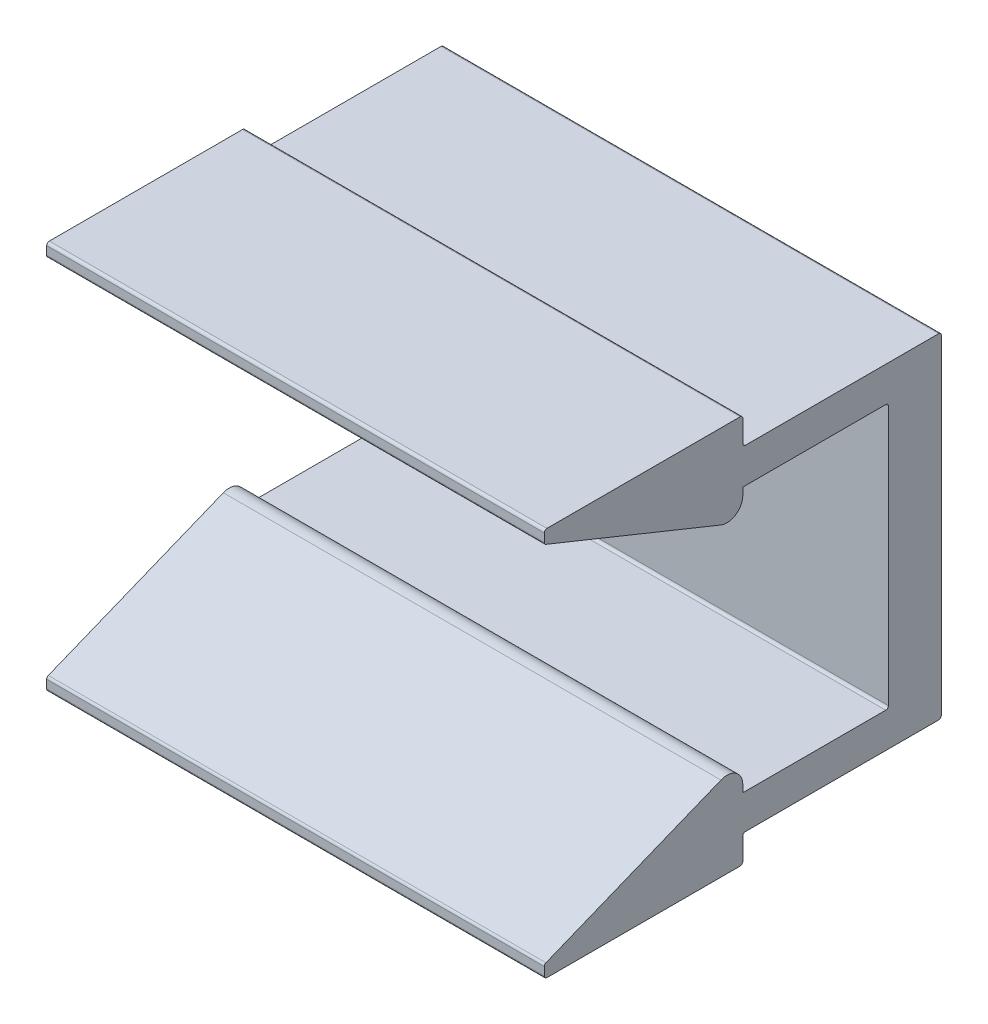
ISO-10303-21;
HEADER;
FILE_DESCRIPTION(('STEP AP214'),'2;1');
FILE_NAME('part.step','',(''),(''),'','','');
FILE_SCHEMA(('AUTOMOTIVE_DESIGN { 1 0 10303 214 1 1 1 1 }'));
ENDSEC;
DATA;
#1=APPLICATION_CONTEXT('core data for automotive mechanical design processes');
#2=APPLICATION_PROTOCOL_DEFINITION('international standard','automotive_design',2000,#1);
#3=PRODUCT_CONTEXT('',#1,'mechanical');
#4=PRODUCT('Part','Part','',(#3));
#5=PRODUCT_RELATED_PRODUCT_CATEGORY('part','',(#4));
#6=PRODUCT_DEFINITION_FORMATION('','',#4);
#7=PRODUCT_DEFINITION_CONTEXT('part definition',#1,'design');
#8=PRODUCT_DEFINITION('design','',#6,#7);
#9=PRODUCT_DEFINITION_SHAPE('','',#8);
#10=(LENGTH_UNIT() NAMED_UNIT(*) SI_UNIT(.MILLI.,.METRE.));
#11=(NAMED_UNIT(*) PLANE_ANGLE_UNIT() SI_UNIT($,.RADIAN.));
#12=(NAMED_UNIT(*) SI_UNIT($,.STERADIAN.) SOLID_ANGLE_UNIT());
#13=UNCERTAINTY_MEASURE_WITH_UNIT(LENGTH_MEASURE(1.E-05),#10,'distance_accuracy_value','');
#14=(GEOMETRIC_REPRESENTATION_CONTEXT(3) GLOBAL_UNCERTAINTY_ASSIGNED_CONTEXT((#13)) GLOBAL_UNIT_ASSIGNED_CONTEXT((#10,
#11,#12)) REPRESENTATION_CONTEXT('',''));
#15=CARTESIAN_POINT('',(0.,0.,0.));
#16=DIRECTION('',(0.,0.,1.));
#17=DIRECTION('',(1.,0.,0.));
#18=AXIS2_PLACEMENT_3D('',#15,#16,#17);
#19=CARTESIAN_POINT('',(11.938,6.223,2.54));
#20=DIRECTION('',(0.,0.,-1.));
#21=DIRECTION('',(0.,1.,0.));
#22=AXIS2_PLACEMENT_3D('',#19,#20,#21);
#23=PLANE('',#22);
#24=DIRECTION('',(0.,-1.,0.));
#25=VECTOR('',#24,1.);
#26=CARTESIAN_POINT('',(-11.938,6.223,2.54));
#27=LINE('',#26,#25);
#28=CARTESIAN_POINT('',(-11.938,6.223,2.54));
#29=VERTEX_POINT('',#28);
#30=CARTESIAN_POINT('',(-11.938,-6.223,2.54));
#31=VERTEX_POINT('',#30);
#32=EDGE_CURVE('E218',#29,#31,#27,.T.);
#33=ORIENTED_EDGE('',*,*,#32,.T.);
#34=DIRECTION('',(-1.,0.,0.));
#35=VECTOR('',#34,1.);
#36=CARTESIAN_POINT('',(11.938,-6.223,2.54));
#37=LINE('',#36,#35);
#38=CARTESIAN_POINT('',(11.938,-6.223,2.54));
#39=VERTEX_POINT('',#38);
#40=EDGE_CURVE('E426',#39,#31,#37,.T.);
#41=ORIENTED_EDGE('',*,*,#40,.F.);
#42=DIRECTION('',(0.,-1.,0.));
#43=VECTOR('',#42,1.);
#44=CARTESIAN_POINT('',(11.938,6.223,2.54));
#45=LINE('',#44,#43);
#46=CARTESIAN_POINT('',(11.938,6.223,2.54));
#47=VERTEX_POINT('',#46);
#48=EDGE_CURVE('E293',#47,#39,#45,.T.);
#49=ORIENTED_EDGE('',*,*,#48,.F.);
#50=DIRECTION('',(-1.,0.,0.));
#51=VECTOR('',#50,1.);
#52=CARTESIAN_POINT('',(11.938,6.223,2.54));
#53=LINE('',#52,#51);
#54=EDGE_CURVE('E23',#47,#29,#53,.T.);
#55=ORIENTED_EDGE('',*,*,#54,.T.);
#56=EDGE_LOOP('',(#33,#41,#49,#55));
#57=FACE_BOUND('',#56,.T.);
#58=CARTESIAN_POINT('',(0.,0.,2.54));
#59=DIRECTION('',(0.,0.,-1.));
#60=DIRECTION('',(0.,1.,0.));
#61=AXIS2_PLACEMENT_3D('',#58,#59,#60);
#62=CIRCLE('',#61,3.3655);
#63=CARTESIAN_POINT('',(0.,3.3655,2.54));
#64=VERTEX_POINT('',#63);
#65=EDGE_CURVE('E230',#64,#64,#62,.F.);
#66=ORIENTED_EDGE('',*,*,#65,.F.);
#67=EDGE_LOOP('',(#66));
#68=FACE_BOUND('',#67,.T.);
#69=ADVANCED_FACE('F14',(#57,#68),#23,.F.);
#70=CARTESIAN_POINT('',(11.938,-7.8994,0.));
#71=DIRECTION('',(0.,0.,1.));
#72=DIRECTION('',(1.,0.,0.));
#73=AXIS2_PLACEMENT_3D('',#70,#71,#72);
#74=PLANE('',#73);
#75=DIRECTION('',(0.,1.,0.));
#76=VECTOR('',#75,1.);
#77=CARTESIAN_POINT('',(-11.938,-7.8994,0.));
#78=LINE('',#77,#76);
#79=CARTESIAN_POINT('',(-11.938,-7.8994,0.));
#80=VERTEX_POINT('',#79);
#81=CARTESIAN_POINT('',(-11.938,7.8994,0.));
#82=VERTEX_POINT('',#81);
#83=EDGE_CURVE('E264',#80,#82,#78,.T.);
#84=ORIENTED_EDGE('',*,*,#83,.T.);
#85=DIRECTION('',(-1.,0.,0.));
#86=VECTOR('',#85,1.);
#87=CARTESIAN_POINT('',(11.938,7.8994,0.));
#88=LINE('',#87,#86);
#89=CARTESIAN_POINT('',(11.938,7.8994,0.));
#90=VERTEX_POINT('',#89);
#91=EDGE_CURVE('E381',#90,#82,#88,.T.);
#92=ORIENTED_EDGE('',*,*,#91,.F.);
#93=DIRECTION('',(0.,1.,0.));
#94=VECTOR('',#93,1.);
#95=CARTESIAN_POINT('',(11.938,-7.8994,0.));
#96=LINE('',#95,#94);
#97=CARTESIAN_POINT('',(11.938,-7.8994,0.));
#98=VERTEX_POINT('',#97);
#99=EDGE_CURVE('E323',#98,#90,#96,.T.);
#100=ORIENTED_EDGE('',*,*,#99,.F.);
#101=DIRECTION('',(-1.,0.,0.));
#102=VECTOR('',#101,1.);
#103=CARTESIAN_POINT('',(11.938,-7.8994,0.));
#104=LINE('',#103,#102);
#105=EDGE_CURVE('E384',#98,#80,#104,.T.);
#106=ORIENTED_EDGE('',*,*,#105,.T.);
#107=EDGE_LOOP('',(#84,#92,#100,#106));
#108=FACE_BOUND('',#107,.T.);
#109=CARTESIAN_POINT('',(0.,0.,0.));
#110=DIRECTION('',(0.,0.,1.));
#111=DIRECTION('',(1.,0.,0.));
#112=AXIS2_PLACEMENT_3D('',#109,#110,#111);
#113=CIRCLE('',#112,3.3655);
#114=CARTESIAN_POINT('',(3.3655,0.,0.));
#115=VERTEX_POINT('',#114);
#116=EDGE_CURVE('E18',#115,#115,#113,.F.);
#117=ORIENTED_EDGE('',*,*,#116,.F.);
#118=EDGE_LOOP('',(#117));
#119=FACE_BOUND('',#118,.T.);
#120=ADVANCED_FACE('F507',(#108,#119),#74,.F.);
#121=CARTESIAN_POINT('',(11.938,6.35,9.525));
#122=DIRECTION('',(0.,1.,0.));
#123=DIRECTION('',(0.,0.,1.));
#124=AXIS2_PLACEMENT_3D('',#121,#122,#123);
#125=PLANE('',#124);
#126=DIRECTION('',(0.,0.,-1.));
#127=VECTOR('',#126,1.);
#128=CARTESIAN_POINT('',(-11.938,6.35,9.525));
#129=LINE('',#128,#127);
#130=CARTESIAN_POINT('',(-11.938,6.35,9.525));
#131=VERTEX_POINT('',#130);
#132=CARTESIAN_POINT('',(-11.938,6.35,2.667));
#133=VERTEX_POINT('',#132);
#134=EDGE_CURVE('E216',#131,#133,#129,.T.);
#135=ORIENTED_EDGE('',*,*,#134,.T.);
#136=DIRECTION('',(-1.,0.,0.));
#137=VECTOR('',#136,1.);
#138=CARTESIAN_POINT('',(11.938,6.35,2.667));
#139=LINE('',#138,#137);
#140=CARTESIAN_POINT('',(11.938,6.35,2.667));
#141=VERTEX_POINT('',#140);
#142=EDGE_CURVE('E9',#141,#133,#139,.T.);
#143=ORIENTED_EDGE('',*,*,#142,.F.);
#144=DIRECTION('',(0.,0.,-1.));
#145=VECTOR('',#144,1.);
#146=CARTESIAN_POINT('',(11.938,6.35,9.525));
#147=LINE('',#146,#145);
#148=CARTESIAN_POINT('',(11.938,6.35,9.525));
#149=VERTEX_POINT('',#148);
#150=EDGE_CURVE('E290',#149,#141,#147,.T.);
#151=ORIENTED_EDGE('',*,*,#150,.F.);
#152=DIRECTION('',(-1.,0.,0.));
#153=VECTOR('',#152,1.);
#154=CARTESIAN_POINT('',(11.938,6.35,9.525));
#155=LINE('',#154,#153);
#156=EDGE_CURVE('E229',#149,#131,#155,.T.);
#157=ORIENTED_EDGE('',*,*,#156,.T.);
#158=EDGE_LOOP('',(#135,#143,#151,#157));
#159=FACE_BOUND('',#158,.T.);
#160=ADVANCED_FACE('F16',(#159),#125,.F.);
#161=CARTESIAN_POINT('',(11.938,6.223,2.667));
#162=DIRECTION('',(-1.,0.,0.));
#163=DIRECTION('',(0.,-1.,0.));
#164=AXIS2_PLACEMENT_3D('',#161,#162,#163);
#165=CYLINDRICAL_SURFACE('',#164,0.127);
#166=CARTESIAN_POINT('',(-11.938,6.223,2.667));
#167=DIRECTION('',(-1.,0.,0.));
#168=DIRECTION('',(0.,-1.,0.));
#169=AXIS2_PLACEMENT_3D('',#166,#167,#168);
#170=CIRCLE('',#169,0.127);
#171=EDGE_CURVE('E212',#133,#29,#170,.T.);
#172=ORIENTED_EDGE('',*,*,#171,.T.);
#173=ORIENTED_EDGE('',*,*,#54,.F.);
#174=CARTESIAN_POINT('',(11.938,6.223,2.667));
#175=DIRECTION('',(-1.,0.,0.));
#176=DIRECTION('',(0.,-1.,0.));
#177=AXIS2_PLACEMENT_3D('',#174,#175,#176);
#178=CIRCLE('',#177,0.127);
#179=EDGE_CURVE('E225',#141,#47,#178,.T.);
#180=ORIENTED_EDGE('',*,*,#179,.F.);
#181=ORIENTED_EDGE('',*,*,#142,.T.);
#182=EDGE_LOOP('',(#172,#173,#180,#181));
#183=FACE_BOUND('',#182,.T.);
#184=ADVANCED_FACE('F224',(#183),#165,.F.);
#185=CARTESIAN_POINT('',(11.938,-6.223,2.667));
#186=DIRECTION('',(-1.,0.,0.));
#187=DIRECTION('',(0.,-1.,0.));
#188=AXIS2_PLACEMENT_3D('',#185,#186,#187);
#189=CYLINDRICAL_SURFACE('',#188,0.127);
#190=CARTESIAN_POINT('',(-11.938,-6.223,2.667));
#191=DIRECTION('',(-1.,0.,0.));
#192=DIRECTION('',(0.,1.,0.));
#193=AXIS2_PLACEMENT_3D('',#190,#191,#192);
#194=CIRCLE('',#193,0.127);
#195=CARTESIAN_POINT('',(-11.938,-6.35,2.667));
#196=VERTEX_POINT('',#195);
#197=EDGE_CURVE('E236',#31,#196,#194,.T.);
#198=ORIENTED_EDGE('',*,*,#197,.T.);
#199=DIRECTION('',(-1.,0.,0.));
#200=VECTOR('',#199,1.);
#201=CARTESIAN_POINT('',(11.938,-6.35,2.667));
#202=LINE('',#201,#200);
#203=CARTESIAN_POINT('',(11.938,-6.35,2.667));
#204=VERTEX_POINT('',#203);
#205=EDGE_CURVE('E423',#204,#196,#202,.T.);
#206=ORIENTED_EDGE('',*,*,#205,.F.);
#207=CARTESIAN_POINT('',(11.938,-6.223,2.667));
#208=DIRECTION('',(-1.,0.,0.));
#209=DIRECTION('',(0.,1.,0.));
#210=AXIS2_PLACEMENT_3D('',#207,#208,#209);
#211=CIRCLE('',#210,0.127);
#212=EDGE_CURVE('E295',#39,#204,#211,.T.);
#213=ORIENTED_EDGE('',*,*,#212,.F.);
#214=ORIENTED_EDGE('',*,*,#40,.T.);
#215=EDGE_LOOP('',(#198,#206,#213,#214));
#216=FACE_BOUND('',#215,.T.);
#217=ADVANCED_FACE('F439',(#216),#189,.F.);
#218=CARTESIAN_POINT('',(11.938,-6.35,9.525));
#219=DIRECTION('',(0.,-1.,0.));
#220=DIRECTION('',(0.,0.,-1.));
#221=AXIS2_PLACEMENT_3D('',#218,#219,#220);
#222=PLANE('',#221);
#223=DIRECTION('',(0.,0.,1.));
#224=VECTOR('',#223,1.);
#225=CARTESIAN_POINT('',(-11.938,-6.35,9.525));
#226=LINE('',#225,#224);
#227=CARTESIAN_POINT('',(-11.938,-6.35,9.525));
#228=VERTEX_POINT('',#227);
#229=EDGE_CURVE('E238',#196,#228,#226,.T.);
#230=ORIENTED_EDGE('',*,*,#229,.T.);
#231=DIRECTION('',(-1.,0.,0.));
#232=VECTOR('',#231,1.);
#233=CARTESIAN_POINT('',(11.938,-6.35,9.525));
#234=LINE('',#233,#232);
#235=CARTESIAN_POINT('',(11.938,-6.35,9.525));
#236=VERTEX_POINT('',#235);
#237=EDGE_CURVE('E420',#236,#228,#234,.T.);
#238=ORIENTED_EDGE('',*,*,#237,.F.);
#239=DIRECTION('',(0.,0.,1.));
#240=VECTOR('',#239,1.);
#241=CARTESIAN_POINT('',(11.938,-6.35,9.525));
#242=LINE('',#241,#240);
#243=EDGE_CURVE('E297',#204,#236,#242,.T.);
#244=ORIENTED_EDGE('',*,*,#243,.F.);
#245=ORIENTED_EDGE('',*,*,#205,.T.);
#246=EDGE_LOOP('',(#230,#238,#244,#245));
#247=FACE_BOUND('',#246,.T.);
#248=ADVANCED_FACE('F442',(#247),#222,.F.);
#249=CARTESIAN_POINT('',(11.938,-6.00626165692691,9.525));
#250=DIRECTION('',(0.,0.,1.));
#251=DIRECTION('',(1.,0.,0.));
#252=AXIS2_PLACEMENT_3D('',#249,#250,#251);
#253=PLANE('',#252);
#254=DIRECTION('',(0.,1.,0.));
#255=VECTOR('',#254,1.);
#256=CARTESIAN_POINT('',(-11.938,-6.00626165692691,9.525));
#257=LINE('',#256,#255);
#258=CARTESIAN_POINT('',(-11.938,-6.00626165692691,9.525));
#259=VERTEX_POINT('',#258);
#260=EDGE_CURVE('E240',#228,#259,#257,.T.);
#261=ORIENTED_EDGE('',*,*,#260,.T.);
#262=DIRECTION('',(-1.,0.,0.));
#263=VECTOR('',#262,1.);
#264=CARTESIAN_POINT('',(11.938,-6.00626165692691,9.525));
#265=LINE('',#264,#263);
#266=CARTESIAN_POINT('',(11.938,-6.00626165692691,9.525));
#267=VERTEX_POINT('',#266);
#268=EDGE_CURVE('E417',#267,#259,#265,.T.);
#269=ORIENTED_EDGE('',*,*,#268,.F.);
#270=DIRECTION('',(0.,1.,0.));
#271=VECTOR('',#270,1.);
#272=CARTESIAN_POINT('',(11.938,-6.00626165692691,9.525));
#273=LINE('',#272,#271);
#274=EDGE_CURVE('E299',#236,#267,#273,.T.);
#275=ORIENTED_EDGE('',*,*,#274,.F.);
#276=ORIENTED_EDGE('',*,*,#237,.T.);
#277=EDGE_LOOP('',(#261,#269,#275,#276));
#278=FACE_BOUND('',#277,.T.);
#279=ADVANCED_FACE('F447',(#278),#253,.F.);
#280=CARTESIAN_POINT('',(11.938,-6.00626165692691,10.287));
#281=DIRECTION('',(-1.,0.,0.));
#282=DIRECTION('',(0.,-1.,0.));
#283=AXIS2_PLACEMENT_3D('',#280,#281,#282);
#284=CYLINDRICAL_SURFACE('',#283,0.762);
#285=CARTESIAN_POINT('',(-11.938,-6.00626165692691,10.287));
#286=DIRECTION('',(1.,0.,0.));
#287=DIRECTION('',(0.,-1.,0.));
#288=AXIS2_PLACEMENT_3D('',#285,#286,#287);
#289=CIRCLE('',#288,0.762);
#290=CARTESIAN_POINT('',(-11.938,-5.29974755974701,10.5724502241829));
#291=VERTEX_POINT('',#290);
#292=EDGE_CURVE('E242',#259,#291,#289,.T.);
#293=ORIENTED_EDGE('',*,*,#292,.T.);
#294=DIRECTION('',(-1.,0.,0.));
#295=VECTOR('',#294,1.);
#296=CARTESIAN_POINT('',(11.938,-5.29974755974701,10.5724502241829));
#297=LINE('',#296,#295);
#298=CARTESIAN_POINT('',(11.938,-5.29974755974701,10.5724502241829));
#299=VERTEX_POINT('',#298);
#300=EDGE_CURVE('E414',#299,#291,#297,.T.);
#301=ORIENTED_EDGE('',*,*,#300,.F.);
#302=CARTESIAN_POINT('',(11.938,-6.00626165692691,10.287));
#303=DIRECTION('',(1.,0.,0.));
#304=DIRECTION('',(0.,-1.,0.));
#305=AXIS2_PLACEMENT_3D('',#302,#303,#304);
#306=CIRCLE('',#305,0.762);
#307=EDGE_CURVE('E301',#267,#299,#306,.T.);
#308=ORIENTED_EDGE('',*,*,#307,.F.);
#309=ORIENTED_EDGE('',*,*,#268,.T.);
#310=EDGE_LOOP('',(#293,#301,#308,#309));
#311=FACE_BOUND('',#310,.T.);
#312=ADVANCED_FACE('F453',(#311),#284,.T.);
#313=CARTESIAN_POINT('',(11.938,-8.69281023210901,18.9705750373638));
#314=DIRECTION('',(0.,-0.92718385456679,-0.374606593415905));
#315=DIRECTION('',(0.,0.374606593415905,-0.92718385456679));
#316=AXIS2_PLACEMENT_3D('',#313,#314,#315);
#317=PLANE('',#316);
#318=DIRECTION('',(0.,-0.374606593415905,0.92718385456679));
#319=VECTOR('',#318,1.);
#320=CARTESIAN_POINT('',(-11.938,-8.69281023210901,18.9705750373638));
#321=LINE('',#320,#319);
#322=CARTESIAN_POINT('',(-11.938,-8.69281023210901,18.9705750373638));
#323=VERTEX_POINT('',#322);
#324=EDGE_CURVE('E244',#291,#323,#321,.T.);
#325=ORIENTED_EDGE('',*,*,#324,.T.);
#326=DIRECTION('',(-1.,0.,0.));
#327=VECTOR('',#326,1.);
#328=CARTESIAN_POINT('',(11.938,-8.69281023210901,18.9705750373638));
#329=LINE('',#328,#327);
#330=CARTESIAN_POINT('',(11.938,-8.69281023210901,18.9705750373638));
#331=VERTEX_POINT('',#330);
#332=EDGE_CURVE('E411',#331,#323,#329,.T.);
#333=ORIENTED_EDGE('',*,*,#332,.F.);
#334=DIRECTION('',(0.,-0.374606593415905,0.92718385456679));
#335=VECTOR('',#334,1.);
#336=CARTESIAN_POINT('',(11.938,-8.69281023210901,18.9705750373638));
#337=LINE('',#336,#335);
#338=EDGE_CURVE('E303',#299,#331,#337,.T.);
#339=ORIENTED_EDGE('',*,*,#338,.F.);
#340=ORIENTED_EDGE('',*,*,#300,.T.);
#341=EDGE_LOOP('',(#325,#333,#339,#340));
#342=FACE_BOUND('',#341,.T.);
#343=ADVANCED_FACE('F457',(#342),#317,.F.);
#344=CARTESIAN_POINT('',(11.938,-8.81056258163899,18.923));
#345=DIRECTION('',(-1.,0.,0.));
#346=DIRECTION('',(0.,-1.,0.));
#347=AXIS2_PLACEMENT_3D('',#344,#345,#346);
#348=CYLINDRICAL_SURFACE('',#347,0.126999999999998);
#349=CARTESIAN_POINT('',(-11.938,-8.81056258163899,18.923));
#350=DIRECTION('',(1.,0.,0.));
#351=DIRECTION('',(0.,-1.,0.));
#352=AXIS2_PLACEMENT_3D('',#349,#350,#351);
#353=CIRCLE('',#352,0.126999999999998);
#354=CARTESIAN_POINT('',(-11.938,-8.81056258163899,19.05));
#355=VERTEX_POINT('',#354);
#356=EDGE_CURVE('E246',#323,#355,#353,.T.);
#357=ORIENTED_EDGE('',*,*,#356,.T.);
#358=DIRECTION('',(-1.,0.,0.));
#359=VECTOR('',#358,1.);
#360=CARTESIAN_POINT('',(11.938,-8.81056258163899,19.05));
#361=LINE('',#360,#359);
#362=CARTESIAN_POINT('',(11.938,-8.81056258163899,19.05));
#363=VERTEX_POINT('',#362);
#364=EDGE_CURVE('E408',#363,#355,#361,.T.);
#365=ORIENTED_EDGE('',*,*,#364,.F.);
#366=CARTESIAN_POINT('',(11.938,-8.81056258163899,18.923));
#367=DIRECTION('',(1.,0.,0.));
#368=DIRECTION('',(0.,-1.,0.));
#369=AXIS2_PLACEMENT_3D('',#366,#367,#368);
#370=CIRCLE('',#369,0.126999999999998);
#371=EDGE_CURVE('E305',#331,#363,#370,.T.);
#372=ORIENTED_EDGE('',*,*,#371,.F.);
#373=ORIENTED_EDGE('',*,*,#332,.T.);
#374=EDGE_LOOP('',(#357,#365,#372,#373));
#375=FACE_BOUND('',#374,.T.);
#376=ADVANCED_FACE('F462',(#375),#348,.T.);
#377=CARTESIAN_POINT('',(11.938,-9.2075,19.05));
#378=DIRECTION('',(0.,0.,-1.));
#379=DIRECTION('',(-1.,0.,0.));
#380=AXIS2_PLACEMENT_3D('',#377,#378,#379);
#381=PLANE('',#380);
#382=DIRECTION('',(0.,-1.,0.));
#383=VECTOR('',#382,1.);
#384=CARTESIAN_POINT('',(-11.938,-9.2075,19.05));
#385=LINE('',#384,#383);
#386=CARTESIAN_POINT('',(-11.938,-9.2075,19.05));
#387=VERTEX_POINT('',#386);
#388=EDGE_CURVE('E248',#355,#387,#385,.T.);
#389=ORIENTED_EDGE('',*,*,#388,.T.);
#390=DIRECTION('',(-1.,0.,0.));
#391=VECTOR('',#390,1.);
#392=CARTESIAN_POINT('',(11.938,-9.2075,19.05));
#393=LINE('',#392,#391);
#394=CARTESIAN_POINT('',(11.938,-9.2075,19.05));
#395=VERTEX_POINT('',#394);
#396=EDGE_CURVE('E405',#395,#387,#393,.T.);
#397=ORIENTED_EDGE('',*,*,#396,.F.);
#398=DIRECTION('',(0.,-1.,0.));
#399=VECTOR('',#398,1.);
#400=CARTESIAN_POINT('',(11.938,-9.2075,19.05));
#401=LINE('',#400,#399);
#402=EDGE_CURVE('E307',#363,#395,#401,.T.);
#403=ORIENTED_EDGE('',*,*,#402,.F.);
#404=ORIENTED_EDGE('',*,*,#364,.T.);
#405=EDGE_LOOP('',(#389,#397,#403,#404));
#406=FACE_BOUND('',#405,.T.);
#407=ADVANCED_FACE('F468',(#406),#381,.F.);
#408=CARTESIAN_POINT('',(11.938,-9.2075,18.923));
#409=DIRECTION('',(-1.,0.,0.));
#410=DIRECTION('',(0.,-1.,0.));
#411=AXIS2_PLACEMENT_3D('',#408,#409,#410);
#412=CYLINDRICAL_SURFACE('',#411,0.126999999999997);
#413=CARTESIAN_POINT('',(-11.938,-9.2075,18.923));
#414=DIRECTION('',(1.,0.,0.));
#415=DIRECTION('',(0.,-1.,0.));
#416=AXIS2_PLACEMENT_3D('',#413,#414,#415);
#417=CIRCLE('',#416,0.126999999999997);
#418=CARTESIAN_POINT('',(-11.938,-9.3345,18.923));
#419=VERTEX_POINT('',#418);
#420=EDGE_CURVE('E250',#387,#419,#417,.T.);
#421=ORIENTED_EDGE('',*,*,#420,.T.);
#422=DIRECTION('',(-1.,0.,0.));
#423=VECTOR('',#422,1.);
#424=CARTESIAN_POINT('',(11.938,-9.3345,18.923));
#425=LINE('',#424,#423);
#426=CARTESIAN_POINT('',(11.938,-9.3345,18.923));
#427=VERTEX_POINT('',#426);
#428=EDGE_CURVE('E402',#427,#419,#425,.T.);
#429=ORIENTED_EDGE('',*,*,#428,.F.);
#430=CARTESIAN_POINT('',(11.938,-9.2075,18.923));
#431=DIRECTION('',(1.,0.,0.));
#432=DIRECTION('',(0.,-1.,0.));
#433=AXIS2_PLACEMENT_3D('',#430,#431,#432);
#434=CIRCLE('',#433,0.126999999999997);
#435=EDGE_CURVE('E309',#395,#427,#434,.T.);
#436=ORIENTED_EDGE('',*,*,#435,.F.);
#437=ORIENTED_EDGE('',*,*,#396,.T.);
#438=EDGE_LOOP('',(#421,#429,#436,#437));
#439=FACE_BOUND('',#438,.T.);
#440=ADVANCED_FACE('F472',(#439),#412,.T.);
#441=CARTESIAN_POINT('',(11.938,-9.3345,9.652));
#442=DIRECTION('',(0.,1.,0.));
#443=DIRECTION('',(0.,0.,1.));
#444=AXIS2_PLACEMENT_3D('',#441,#442,#443);
#445=PLANE('',#444);
#446=DIRECTION('',(0.,0.,-1.));
#447=VECTOR('',#446,1.);
#448=CARTESIAN_POINT('',(-11.938,-9.3345,9.652));
#449=LINE('',#448,#447);
#450=CARTESIAN_POINT('',(-11.938,-9.3345,9.652));
#451=VERTEX_POINT('',#450);
#452=EDGE_CURVE('E252',#419,#451,#449,.T.);
#453=ORIENTED_EDGE('',*,*,#452,.T.);
#454=DIRECTION('',(-1.,0.,0.));
#455=VECTOR('',#454,1.);
#456=CARTESIAN_POINT('',(11.938,-9.3345,9.652));
#457=LINE('',#456,#455);
#458=CARTESIAN_POINT('',(11.938,-9.3345,9.652));
#459=VERTEX_POINT('',#458);
#460=EDGE_CURVE('E399',#459,#451,#457,.T.);
#461=ORIENTED_EDGE('',*,*,#460,.F.);
#462=DIRECTION('',(0.,0.,-1.));
#463=VECTOR('',#462,1.);
#464=CARTESIAN_POINT('',(11.938,-9.3345,9.652));
#465=LINE('',#464,#463);
#466=EDGE_CURVE('E311',#427,#459,#465,.T.);
#467=ORIENTED_EDGE('',*,*,#466,.F.);
#468=ORIENTED_EDGE('',*,*,#428,.T.);
#469=EDGE_LOOP('',(#453,#461,#467,#468));
#470=FACE_BOUND('',#469,.T.);
#471=ADVANCED_FACE('F477',(#470),#445,.F.);
#472=CARTESIAN_POINT('',(11.938,-9.2075,9.652));
#473=DIRECTION('',(-1.,0.,0.));
#474=DIRECTION('',(0.,-1.,0.));
#475=AXIS2_PLACEMENT_3D('',#472,#473,#474);
#476=CYLINDRICAL_SURFACE('',#475,0.127);
#477=CARTESIAN_POINT('',(-11.938,-9.2075,9.652));
#478=DIRECTION('',(1.,0.,0.));
#479=DIRECTION('',(0.,-1.,0.));
#480=AXIS2_PLACEMENT_3D('',#477,#478,#479);
#481=CIRCLE('',#480,0.127);
#482=CARTESIAN_POINT('',(-11.938,-9.2075,9.525));
#483=VERTEX_POINT('',#482);
#484=EDGE_CURVE('E254',#451,#483,#481,.T.);
#485=ORIENTED_EDGE('',*,*,#484,.T.);
#486=DIRECTION('',(-1.,0.,0.));
#487=VECTOR('',#486,1.);
#488=CARTESIAN_POINT('',(11.938,-9.2075,9.525));
#489=LINE('',#488,#487);
#490=CARTESIAN_POINT('',(11.938,-9.2075,9.525));
#491=VERTEX_POINT('',#490);
#492=EDGE_CURVE('E396',#491,#483,#489,.T.);
#493=ORIENTED_EDGE('',*,*,#492,.F.);
#494=CARTESIAN_POINT('',(11.938,-9.2075,9.652));
#495=DIRECTION('',(1.,0.,0.));
#496=DIRECTION('',(0.,-1.,0.));
#497=AXIS2_PLACEMENT_3D('',#494,#495,#496);
#498=CIRCLE('',#497,0.127);
#499=EDGE_CURVE('E313',#459,#491,#498,.T.);
#500=ORIENTED_EDGE('',*,*,#499,.F.);
#501=ORIENTED_EDGE('',*,*,#460,.T.);
#502=EDGE_LOOP('',(#485,#493,#500,#501));
#503=FACE_BOUND('',#502,.T.);
#504=ADVANCED_FACE('F483',(#503),#476,.T.);
#505=CARTESIAN_POINT('',(11.938,-8.1534,9.525));
#506=DIRECTION('',(0.,0.,1.));
#507=DIRECTION('',(1.,0.,0.));
#508=AXIS2_PLACEMENT_3D('',#505,#506,#507);
#509=PLANE('',#508);
#510=DIRECTION('',(0.,1.,0.));
#511=VECTOR('',#510,1.);
#512=CARTESIAN_POINT('',(-11.938,-8.1534,9.525));
#513=LINE('',#512,#511);
#514=CARTESIAN_POINT('',(-11.938,-8.1534,9.525));
#515=VERTEX_POINT('',#514);
#516=EDGE_CURVE('E256',#483,#515,#513,.T.);
#517=ORIENTED_EDGE('',*,*,#516,.T.);
#518=DIRECTION('',(-1.,0.,0.));
#519=VECTOR('',#518,1.);
#520=CARTESIAN_POINT('',(11.938,-8.1534,9.525));
#521=LINE('',#520,#519);
#522=CARTESIAN_POINT('',(11.938,-8.1534,9.525));
#523=VERTEX_POINT('',#522);
#524=EDGE_CURVE('E393',#523,#515,#521,.T.);
#525=ORIENTED_EDGE('',*,*,#524,.F.);
#526=DIRECTION('',(0.,1.,0.));
#527=VECTOR('',#526,1.);
#528=CARTESIAN_POINT('',(11.938,-8.1534,9.525));
#529=LINE('',#528,#527);
#530=EDGE_CURVE('E315',#491,#523,#529,.T.);
#531=ORIENTED_EDGE('',*,*,#530,.F.);
#532=ORIENTED_EDGE('',*,*,#492,.T.);
#533=EDGE_LOOP('',(#517,#525,#531,#532));
#534=FACE_BOUND('',#533,.T.);
#535=ADVANCED_FACE('F487',(#534),#509,.F.);
#536=CARTESIAN_POINT('',(11.938,-8.1534,9.398));
#537=DIRECTION('',(-1.,0.,0.));
#538=DIRECTION('',(0.,-1.,0.));
#539=AXIS2_PLACEMENT_3D('',#536,#537,#538);
#540=CYLINDRICAL_SURFACE('',#539,0.127);
#541=CARTESIAN_POINT('',(-11.938,-8.1534,9.398));
#542=DIRECTION('',(-1.,0.,0.));
#543=DIRECTION('',(0.,1.,0.));
#544=AXIS2_PLACEMENT_3D('',#541,#542,#543);
#545=CIRCLE('',#544,0.127);
#546=CARTESIAN_POINT('',(-11.938,-8.0264,9.398));
#547=VERTEX_POINT('',#546);
#548=EDGE_CURVE('E258',#515,#547,#545,.T.);
#549=ORIENTED_EDGE('',*,*,#548,.T.);
#550=DIRECTION('',(-1.,0.,0.));
#551=VECTOR('',#550,1.);
#552=CARTESIAN_POINT('',(11.938,-8.0264,9.398));
#553=LINE('',#552,#551);
#554=CARTESIAN_POINT('',(11.938,-8.0264,9.398));
#555=VERTEX_POINT('',#554);
#556=EDGE_CURVE('E390',#555,#547,#553,.T.);
#557=ORIENTED_EDGE('',*,*,#556,.F.);
#558=CARTESIAN_POINT('',(11.938,-8.1534,9.398));
#559=DIRECTION('',(-1.,0.,0.));
#560=DIRECTION('',(0.,1.,0.));
#561=AXIS2_PLACEMENT_3D('',#558,#559,#560);
#562=CIRCLE('',#561,0.127);
#563=EDGE_CURVE('E317',#523,#555,#562,.T.);
#564=ORIENTED_EDGE('',*,*,#563,.F.);
#565=ORIENTED_EDGE('',*,*,#524,.T.);
#566=EDGE_LOOP('',(#549,#557,#564,#565));
#567=FACE_BOUND('',#566,.T.);
#568=ADVANCED_FACE('F492',(#567),#540,.F.);
#569=CARTESIAN_POINT('',(11.938,-8.0264,0.127));
#570=DIRECTION('',(0.,1.,0.));
#571=DIRECTION('',(-1.,0.,0.));
#572=AXIS2_PLACEMENT_3D('',#569,#570,#571);
#573=PLANE('',#572);
#574=DIRECTION('',(0.,0.,-1.));
#575=VECTOR('',#574,1.);
#576=CARTESIAN_POINT('',(-11.938,-8.0264,0.127));
#577=LINE('',#576,#575);
#578=CARTESIAN_POINT('',(-11.938,-8.0264,0.127));
#579=VERTEX_POINT('',#578);
#580=EDGE_CURVE('E260',#547,#579,#577,.T.);
#581=ORIENTED_EDGE('',*,*,#580,.T.);
#582=DIRECTION('',(-1.,0.,0.));
#583=VECTOR('',#582,1.);
#584=CARTESIAN_POINT('',(11.938,-8.0264,0.127));
#585=LINE('',#584,#583);
#586=CARTESIAN_POINT('',(11.938,-8.0264,0.127));
#587=VERTEX_POINT('',#586);
#588=EDGE_CURVE('E387',#587,#579,#585,.T.);
#589=ORIENTED_EDGE('',*,*,#588,.F.);
#590=DIRECTION('',(0.,0.,-1.));
#591=VECTOR('',#590,1.);
#592=CARTESIAN_POINT('',(11.938,-8.0264,0.127));
#593=LINE('',#592,#591);
#594=EDGE_CURVE('E319',#555,#587,#593,.T.);
#595=ORIENTED_EDGE('',*,*,#594,.F.);
#596=ORIENTED_EDGE('',*,*,#556,.T.);
#597=EDGE_LOOP('',(#581,#589,#595,#596));
#598=FACE_BOUND('',#597,.T.);
#599=ADVANCED_FACE('F498',(#598),#573,.F.);
#600=CARTESIAN_POINT('',(11.938,-7.8994,0.127));
#601=DIRECTION('',(-1.,0.,0.));
#602=DIRECTION('',(0.,-1.,0.));
#603=AXIS2_PLACEMENT_3D('',#600,#601,#602);
#604=CYLINDRICAL_SURFACE('',#603,0.127);
#605=CARTESIAN_POINT('',(-11.938,-7.8994,0.127));
#606=DIRECTION('',(1.,0.,0.));
#607=DIRECTION('',(0.,-1.,0.));
#608=AXIS2_PLACEMENT_3D('',#605,#606,#607);
#609=CIRCLE('',#608,0.127);
#610=EDGE_CURVE('E262',#579,#80,#609,.T.);
#611=ORIENTED_EDGE('',*,*,#610,.T.);
#612=ORIENTED_EDGE('',*,*,#105,.F.);
#613=CARTESIAN_POINT('',(11.938,-7.8994,0.127));
#614=DIRECTION('',(1.,0.,0.));
#615=DIRECTION('',(0.,-1.,0.));
#616=AXIS2_PLACEMENT_3D('',#613,#614,#615);
#617=CIRCLE('',#616,0.127);
#618=EDGE_CURVE('E321',#587,#98,#617,.T.);
#619=ORIENTED_EDGE('',*,*,#618,.F.);
#620=ORIENTED_EDGE('',*,*,#588,.T.);
#621=EDGE_LOOP('',(#611,#612,#619,#620));
#622=FACE_BOUND('',#621,.T.);
#623=ADVANCED_FACE('F502',(#622),#604,.T.);
#624=CARTESIAN_POINT('',(11.938,7.8994,0.127));
#625=DIRECTION('',(-1.,0.,0.));
#626=DIRECTION('',(0.,-1.,0.));
#627=AXIS2_PLACEMENT_3D('',#624,#625,#626);
#628=CYLINDRICAL_SURFACE('',#627,0.127);
#629=CARTESIAN_POINT('',(-11.938,7.8994,0.127));
#630=DIRECTION('',(1.,0.,0.));
#631=DIRECTION('',(0.,1.,0.));
#632=AXIS2_PLACEMENT_3D('',#629,#630,#631);
#633=CIRCLE('',#632,0.127);
#634=CARTESIAN_POINT('',(-11.938,8.0264,0.127));
#635=VERTEX_POINT('',#634);
#636=EDGE_CURVE('E266',#82,#635,#633,.T.);
#637=ORIENTED_EDGE('',*,*,#636,.T.);
#638=DIRECTION('',(-1.,0.,0.));
#639=VECTOR('',#638,1.);
#640=CARTESIAN_POINT('',(11.938,8.0264,0.127));
#641=LINE('',#640,#639);
#642=CARTESIAN_POINT('',(11.938,8.0264,0.127));
#643=VERTEX_POINT('',#642);
#644=EDGE_CURVE('E378',#643,#635,#641,.T.);
#645=ORIENTED_EDGE('',*,*,#644,.F.);
#646=CARTESIAN_POINT('',(11.938,7.8994,0.127));
#647=DIRECTION('',(1.,0.,0.));
#648=DIRECTION('',(0.,1.,0.));
#649=AXIS2_PLACEMENT_3D('',#646,#647,#648);
#650=CIRCLE('',#649,0.127);
#651=EDGE_CURVE('E325',#90,#643,#650,.T.);
#652=ORIENTED_EDGE('',*,*,#651,.F.);
#653=ORIENTED_EDGE('',*,*,#91,.T.);
#654=EDGE_LOOP('',(#637,#645,#652,#653));
#655=FACE_BOUND('',#654,.T.);
#656=ADVANCED_FACE('F514',(#655),#628,.T.);
#657=CARTESIAN_POINT('',(11.938,8.0264,0.127));
#658=DIRECTION('',(0.,-1.,0.));
#659=DIRECTION('',(1.,0.,0.));
#660=AXIS2_PLACEMENT_3D('',#657,#658,#659);
#661=PLANE('',#660);
#662=DIRECTION('',(0.,0.,1.));
#663=VECTOR('',#662,1.);
#664=CARTESIAN_POINT('',(-11.938,8.0264,0.127));
#665=LINE('',#664,#663);
#666=CARTESIAN_POINT('',(-11.938,8.0264,9.398));
#667=VERTEX_POINT('',#666);
#668=EDGE_CURVE('E268',#635,#667,#665,.T.);
#669=ORIENTED_EDGE('',*,*,#668,.T.);
#670=DIRECTION('',(-1.,0.,0.));
#671=VECTOR('',#670,1.);
#672=CARTESIAN_POINT('',(11.938,8.0264,9.398));
#673=LINE('',#672,#671);
#674=CARTESIAN_POINT('',(11.938,8.0264,9.398));
#675=VERTEX_POINT('',#674);
#676=EDGE_CURVE('E375',#675,#667,#673,.T.);
#677=ORIENTED_EDGE('',*,*,#676,.F.);
#678=DIRECTION('',(0.,0.,1.));
#679=VECTOR('',#678,1.);
#680=CARTESIAN_POINT('',(11.938,8.0264,0.127));
#681=LINE('',#680,#679);
#682=EDGE_CURVE('E327',#643,#675,#681,.T.);
#683=ORIENTED_EDGE('',*,*,#682,.F.);
#684=ORIENTED_EDGE('',*,*,#644,.T.);
#685=EDGE_LOOP('',(#669,#677,#683,#684));
#686=FACE_BOUND('',#685,.T.);
#687=ADVANCED_FACE('F518',(#686),#661,.F.);
#688=CARTESIAN_POINT('',(11.938,8.1534,9.398));
#689=DIRECTION('',(-1.,0.,0.));
#690=DIRECTION('',(0.,-1.,0.));
#691=AXIS2_PLACEMENT_3D('',#688,#689,#690);
#692=CYLINDRICAL_SURFACE('',#691,0.127);
#693=CARTESIAN_POINT('',(-11.938,8.1534,9.398));
#694=DIRECTION('',(-1.,0.,0.));
#695=DIRECTION('',(0.,-1.,0.));
#696=AXIS2_PLACEMENT_3D('',#693,#694,#695);
#697=CIRCLE('',#696,0.127);
#698=CARTESIAN_POINT('',(-11.938,8.1534,9.525));
#699=VERTEX_POINT('',#698);
#700=EDGE_CURVE('E270',#667,#699,#697,.T.);
#701=ORIENTED_EDGE('',*,*,#700,.T.);
#702=DIRECTION('',(-1.,0.,0.));
#703=VECTOR('',#702,1.);
#704=CARTESIAN_POINT('',(11.938,8.1534,9.525));
#705=LINE('',#704,#703);
#706=CARTESIAN_POINT('',(11.938,8.1534,9.525));
#707=VERTEX_POINT('',#706);
#708=EDGE_CURVE('E372',#707,#699,#705,.T.);
#709=ORIENTED_EDGE('',*,*,#708,.F.);
#710=CARTESIAN_POINT('',(11.938,8.1534,9.398));
#711=DIRECTION('',(-1.,0.,0.));
#712=DIRECTION('',(0.,-1.,0.));
#713=AXIS2_PLACEMENT_3D('',#710,#711,#712);
#714=CIRCLE('',#713,0.127);
#715=EDGE_CURVE('E329',#675,#707,#714,.T.);
#716=ORIENTED_EDGE('',*,*,#715,.F.);
#717=ORIENTED_EDGE('',*,*,#676,.T.);
#718=EDGE_LOOP('',(#701,#709,#716,#717));
#719=FACE_BOUND('',#718,.T.);
#720=ADVANCED_FACE('F523',(#719),#692,.F.);
#721=CARTESIAN_POINT('',(11.938,8.1534,9.525));
#722=DIRECTION('',(0.,0.,1.));
#723=DIRECTION('',(1.,0.,0.));
#724=AXIS2_PLACEMENT_3D('',#721,#722,#723);
#725=PLANE('',#724);
#726=DIRECTION('',(0.,1.,0.));
#727=VECTOR('',#726,1.);
#728=CARTESIAN_POINT('',(-11.938,8.1534,9.525));
#729=LINE('',#728,#727);
#730=CARTESIAN_POINT('',(-11.938,9.2075,9.525));
#731=VERTEX_POINT('',#730);
#732=EDGE_CURVE('E272',#699,#731,#729,.T.);
#733=ORIENTED_EDGE('',*,*,#732,.T.);
#734=DIRECTION('',(-1.,0.,0.));
#735=VECTOR('',#734,1.);
#736=CARTESIAN_POINT('',(11.938,9.2075,9.525));
#737=LINE('',#736,#735);
#738=CARTESIAN_POINT('',(11.938,9.2075,9.525));
#739=VERTEX_POINT('',#738);
#740=EDGE_CURVE('E369',#739,#731,#737,.T.);
#741=ORIENTED_EDGE('',*,*,#740,.F.);
#742=DIRECTION('',(0.,1.,0.));
#743=VECTOR('',#742,1.);
#744=CARTESIAN_POINT('',(11.938,8.1534,9.525));
#745=LINE('',#744,#743);
#746=EDGE_CURVE('E331',#707,#739,#745,.T.);
#747=ORIENTED_EDGE('',*,*,#746,.F.);
#748=ORIENTED_EDGE('',*,*,#708,.T.);
#749=EDGE_LOOP('',(#733,#741,#747,#748));
#750=FACE_BOUND('',#749,.T.);
#751=ADVANCED_FACE('F529',(#750),#725,.F.);
#752=CARTESIAN_POINT('',(11.938,9.2075,9.652));
#753=DIRECTION('',(-1.,0.,0.));
#754=DIRECTION('',(0.,-1.,0.));
#755=AXIS2_PLACEMENT_3D('',#752,#753,#754);
#756=CYLINDRICAL_SURFACE('',#755,0.127);
#757=CARTESIAN_POINT('',(-11.938,9.2075,9.652));
#758=DIRECTION('',(1.,0.,0.));
#759=DIRECTION('',(0.,1.,0.));
#760=AXIS2_PLACEMENT_3D('',#757,#758,#759);
#761=CIRCLE('',#760,0.127);
#762=CARTESIAN_POINT('',(-11.938,9.3345,9.652));
#763=VERTEX_POINT('',#762);
#764=EDGE_CURVE('E274',#731,#763,#761,.T.);
#765=ORIENTED_EDGE('',*,*,#764,.T.);
#766=DIRECTION('',(-1.,0.,0.));
#767=VECTOR('',#766,1.);
#768=CARTESIAN_POINT('',(11.938,9.3345,9.652));
#769=LINE('',#768,#767);
#770=CARTESIAN_POINT('',(11.938,9.3345,9.652));
#771=VERTEX_POINT('',#770);
#772=EDGE_CURVE('E366',#771,#763,#769,.T.);
#773=ORIENTED_EDGE('',*,*,#772,.F.);
#774=CARTESIAN_POINT('',(11.938,9.2075,9.652));
#775=DIRECTION('',(1.,0.,0.));
#776=DIRECTION('',(0.,1.,0.));
#777=AXIS2_PLACEMENT_3D('',#774,#775,#776);
#778=CIRCLE('',#777,0.127);
#779=EDGE_CURVE('E333',#739,#771,#778,.T.);
#780=ORIENTED_EDGE('',*,*,#779,.F.);
#781=ORIENTED_EDGE('',*,*,#740,.T.);
#782=EDGE_LOOP('',(#765,#773,#780,#781));
#783=FACE_BOUND('',#782,.T.);
#784=ADVANCED_FACE('F533',(#783),#756,.T.);
#785=CARTESIAN_POINT('',(11.938,9.3345,9.652));
#786=DIRECTION('',(0.,-1.,0.));
#787=DIRECTION('',(0.,0.,-1.));
#788=AXIS2_PLACEMENT_3D('',#785,#786,#787);
#789=PLANE('',#788);
#790=DIRECTION('',(0.,0.,1.));
#791=VECTOR('',#790,1.);
#792=CARTESIAN_POINT('',(-11.938,9.3345,9.652));
#793=LINE('',#792,#791);
#794=CARTESIAN_POINT('',(-11.938,9.3345,18.923));
#795=VERTEX_POINT('',#794);
#796=EDGE_CURVE('E276',#763,#795,#793,.T.);
#797=ORIENTED_EDGE('',*,*,#796,.T.);
#798=DIRECTION('',(-1.,0.,0.));
#799=VECTOR('',#798,1.);
#800=CARTESIAN_POINT('',(11.938,9.3345,18.923));
#801=LINE('',#800,#799);
#802=CARTESIAN_POINT('',(11.938,9.3345,18.923));
#803=VERTEX_POINT('',#802);
#804=EDGE_CURVE('E363',#803,#795,#801,.T.);
#805=ORIENTED_EDGE('',*,*,#804,.F.);
#806=DIRECTION('',(0.,0.,1.));
#807=VECTOR('',#806,1.);
#808=CARTESIAN_POINT('',(11.938,9.3345,9.652));
#809=LINE('',#808,#807);
#810=EDGE_CURVE('E335',#771,#803,#809,.T.);
#811=ORIENTED_EDGE('',*,*,#810,.F.);
#812=ORIENTED_EDGE('',*,*,#772,.T.);
#813=EDGE_LOOP('',(#797,#805,#811,#812));
#814=FACE_BOUND('',#813,.T.);
#815=ADVANCED_FACE('F538',(#814),#789,.F.);
#816=CARTESIAN_POINT('',(11.938,9.2075,18.923));
#817=DIRECTION('',(-1.,0.,0.));
#818=DIRECTION('',(0.,-1.,0.));
#819=AXIS2_PLACEMENT_3D('',#816,#817,#818);
#820=CYLINDRICAL_SURFACE('',#819,0.126999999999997);
#821=CARTESIAN_POINT('',(-11.938,9.2075,18.923));
#822=DIRECTION('',(1.,0.,0.));
#823=DIRECTION('',(0.,1.,0.));
#824=AXIS2_PLACEMENT_3D('',#821,#822,#823);
#825=CIRCLE('',#824,0.126999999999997);
#826=CARTESIAN_POINT('',(-11.938,9.2075,19.05));
#827=VERTEX_POINT('',#826);
#828=EDGE_CURVE('E278',#795,#827,#825,.T.);
#829=ORIENTED_EDGE('',*,*,#828,.T.);
#830=DIRECTION('',(-1.,0.,0.));
#831=VECTOR('',#830,1.);
#832=CARTESIAN_POINT('',(11.938,9.2075,19.05));
#833=LINE('',#832,#831);
#834=CARTESIAN_POINT('',(11.938,9.2075,19.05));
#835=VERTEX_POINT('',#834);
#836=EDGE_CURVE('E360',#835,#827,#833,.T.);
#837=ORIENTED_EDGE('',*,*,#836,.F.);
#838=CARTESIAN_POINT('',(11.938,9.2075,18.923));
#839=DIRECTION('',(1.,0.,0.));
#840=DIRECTION('',(0.,1.,0.));
#841=AXIS2_PLACEMENT_3D('',#838,#839,#840);
#842=CIRCLE('',#841,0.126999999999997);
#843=EDGE_CURVE('E337',#803,#835,#842,.T.);
#844=ORIENTED_EDGE('',*,*,#843,.F.);
#845=ORIENTED_EDGE('',*,*,#804,.T.);
#846=EDGE_LOOP('',(#829,#837,#844,#845));
#847=FACE_BOUND('',#846,.T.);
#848=ADVANCED_FACE('F544',(#847),#820,.T.);
#849=CARTESIAN_POINT('',(11.938,9.2075,19.05));
#850=DIRECTION('',(0.,0.,-1.));
#851=DIRECTION('',(-1.,0.,0.));
#852=AXIS2_PLACEMENT_3D('',#849,#850,#851);
#853=PLANE('',#852);
#854=DIRECTION('',(0.,-1.,0.));
#855=VECTOR('',#854,1.);
#856=CARTESIAN_POINT('',(-11.938,9.2075,19.05));
#857=LINE('',#856,#855);
#858=CARTESIAN_POINT('',(-11.938,8.81056258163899,19.05));
#859=VERTEX_POINT('',#858);
#860=EDGE_CURVE('E280',#827,#859,#857,.T.);
#861=ORIENTED_EDGE('',*,*,#860,.T.);
#862=DIRECTION('',(-1.,0.,0.));
#863=VECTOR('',#862,1.);
#864=CARTESIAN_POINT('',(11.938,8.81056258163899,19.05));
#865=LINE('',#864,#863);
#866=CARTESIAN_POINT('',(11.938,8.81056258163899,19.05));
#867=VERTEX_POINT('',#866);
#868=EDGE_CURVE('E357',#867,#859,#865,.T.);
#869=ORIENTED_EDGE('',*,*,#868,.F.);
#870=DIRECTION('',(0.,-1.,0.));
#871=VECTOR('',#870,1.);
#872=CARTESIAN_POINT('',(11.938,9.2075,19.05));
#873=LINE('',#872,#871);
#874=EDGE_CURVE('E339',#835,#867,#873,.T.);
#875=ORIENTED_EDGE('',*,*,#874,.F.);
#876=ORIENTED_EDGE('',*,*,#836,.T.);
#877=EDGE_LOOP('',(#861,#869,#875,#876));
#878=FACE_BOUND('',#877,.T.);
#879=ADVANCED_FACE('F548',(#878),#853,.F.);
#880=CARTESIAN_POINT('',(11.938,8.81056258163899,18.923));
#881=DIRECTION('',(-1.,0.,0.));
#882=DIRECTION('',(0.,-1.,0.));
#883=AXIS2_PLACEMENT_3D('',#880,#881,#882);
#884=CYLINDRICAL_SURFACE('',#883,0.126999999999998);
#885=CARTESIAN_POINT('',(-11.938,8.81056258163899,18.923));
#886=DIRECTION('',(1.,0.,0.));
#887=DIRECTION('',(0.,1.,0.));
#888=AXIS2_PLACEMENT_3D('',#885,#886,#887);
#889=CIRCLE('',#888,0.126999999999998);
#890=CARTESIAN_POINT('',(-11.938,8.69281023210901,18.9705750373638));
#891=VERTEX_POINT('',#890);
#892=EDGE_CURVE('E282',#859,#891,#889,.T.);
#893=ORIENTED_EDGE('',*,*,#892,.T.);
#894=DIRECTION('',(-1.,0.,0.));
#895=VECTOR('',#894,1.);
#896=CARTESIAN_POINT('',(11.938,8.69281023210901,18.9705750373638));
#897=LINE('',#896,#895);
#898=CARTESIAN_POINT('',(11.938,8.69281023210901,18.9705750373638));
#899=VERTEX_POINT('',#898);
#900=EDGE_CURVE('E354',#899,#891,#897,.T.);
#901=ORIENTED_EDGE('',*,*,#900,.F.);
#902=CARTESIAN_POINT('',(11.938,8.81056258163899,18.923));
#903=DIRECTION('',(1.,0.,0.));
#904=DIRECTION('',(0.,1.,0.));
#905=AXIS2_PLACEMENT_3D('',#902,#903,#904);
#906=CIRCLE('',#905,0.126999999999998);
#907=EDGE_CURVE('E341',#867,#899,#906,.T.);
#908=ORIENTED_EDGE('',*,*,#907,.F.);
#909=ORIENTED_EDGE('',*,*,#868,.T.);
#910=EDGE_LOOP('',(#893,#901,#908,#909));
#911=FACE_BOUND('',#910,.T.);
#912=ADVANCED_FACE('F553',(#911),#884,.T.);
#913=CARTESIAN_POINT('',(11.938,8.69281023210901,18.9705750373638));
#914=DIRECTION('',(0.,0.92718385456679,-0.374606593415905));
#915=DIRECTION('',(0.,0.374606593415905,0.92718385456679));
#916=AXIS2_PLACEMENT_3D('',#913,#914,#915);
#917=PLANE('',#916);
#918=DIRECTION('',(0.,-0.374606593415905,-0.92718385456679));
#919=VECTOR('',#918,1.);
#920=CARTESIAN_POINT('',(-11.938,8.69281023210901,18.9705750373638));
#921=LINE('',#920,#919);
#922=CARTESIAN_POINT('',(-11.938,5.29974755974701,10.5724502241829));
#923=VERTEX_POINT('',#922);
#924=EDGE_CURVE('E284',#891,#923,#921,.T.);
#925=ORIENTED_EDGE('',*,*,#924,.T.);
#926=DIRECTION('',(-1.,0.,0.));
#927=VECTOR('',#926,1.);
#928=CARTESIAN_POINT('',(11.938,5.29974755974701,10.5724502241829));
#929=LINE('',#928,#927);
#930=CARTESIAN_POINT('',(11.938,5.29974755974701,10.5724502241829));
#931=VERTEX_POINT('',#930);
#932=EDGE_CURVE('E351',#931,#923,#929,.T.);
#933=ORIENTED_EDGE('',*,*,#932,.F.);
#934=DIRECTION('',(0.,-0.374606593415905,-0.92718385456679));
#935=VECTOR('',#934,1.);
#936=CARTESIAN_POINT('',(11.938,8.69281023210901,18.9705750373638));
#937=LINE('',#936,#935);
#938=EDGE_CURVE('E343',#899,#931,#937,.T.);
#939=ORIENTED_EDGE('',*,*,#938,.F.);
#940=ORIENTED_EDGE('',*,*,#900,.T.);
#941=EDGE_LOOP('',(#925,#933,#939,#940));
#942=FACE_BOUND('',#941,.T.);
#943=ADVANCED_FACE('F557',(#942),#917,.F.);
#944=CARTESIAN_POINT('',(11.938,6.00626165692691,10.287));
#945=DIRECTION('',(-1.,0.,0.));
#946=DIRECTION('',(0.,-1.,0.));
#947=AXIS2_PLACEMENT_3D('',#944,#945,#946);
#948=CYLINDRICAL_SURFACE('',#947,0.762);
#949=CARTESIAN_POINT('',(-11.938,6.00626165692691,10.287));
#950=DIRECTION('',(1.,0.,0.));
#951=DIRECTION('',(0.,1.,0.));
#952=AXIS2_PLACEMENT_3D('',#949,#950,#951);
#953=CIRCLE('',#952,0.762);
#954=CARTESIAN_POINT('',(-11.938,6.00626165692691,9.525));
#955=VERTEX_POINT('',#954);
#956=EDGE_CURVE('E286',#923,#955,#953,.T.);
#957=ORIENTED_EDGE('',*,*,#956,.T.);
#958=DIRECTION('',(-1.,0.,0.));
#959=VECTOR('',#958,1.);
#960=CARTESIAN_POINT('',(11.938,6.00626165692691,9.525));
#961=LINE('',#960,#959);
#962=CARTESIAN_POINT('',(11.938,6.00626165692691,9.525));
#963=VERTEX_POINT('',#962);
#964=EDGE_CURVE('E348',#963,#955,#961,.T.);
#965=ORIENTED_EDGE('',*,*,#964,.F.);
#966=CARTESIAN_POINT('',(11.938,6.00626165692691,10.287));
#967=DIRECTION('',(1.,0.,0.));
#968=DIRECTION('',(0.,1.,0.));
#969=AXIS2_PLACEMENT_3D('',#966,#967,#968);
#970=CIRCLE('',#969,0.762);
#971=EDGE_CURVE('E35',#931,#963,#970,.T.);
#972=ORIENTED_EDGE('',*,*,#971,.F.);
#973=ORIENTED_EDGE('',*,*,#932,.T.);
#974=EDGE_LOOP('',(#957,#965,#972,#973));
#975=FACE_BOUND('',#974,.T.);
#976=ADVANCED_FACE('F561',(#975),#948,.T.);
#977=CARTESIAN_POINT('',(11.938,6.00626165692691,9.525));
#978=DIRECTION('',(0.,0.,1.));
#979=DIRECTION('',(1.,0.,0.));
#980=AXIS2_PLACEMENT_3D('',#977,#978,#979);
#981=PLANE('',#980);
#982=DIRECTION('',(0.,1.,0.));
#983=VECTOR('',#982,1.);
#984=CARTESIAN_POINT('',(-11.938,6.00626165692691,9.525));
#985=LINE('',#984,#983);
#986=EDGE_CURVE('E288',#955,#131,#985,.T.);
#987=ORIENTED_EDGE('',*,*,#986,.T.);
#988=ORIENTED_EDGE('',*,*,#156,.F.);
#989=DIRECTION('',(0.,1.,0.));
#990=VECTOR('',#989,1.);
#991=CARTESIAN_POINT('',(11.938,6.00626165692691,9.525));
#992=LINE('',#991,#990);
#993=EDGE_CURVE('E30',#963,#149,#992,.T.);
#994=ORIENTED_EDGE('',*,*,#993,.F.);
#995=ORIENTED_EDGE('',*,*,#964,.T.);
#996=EDGE_LOOP('',(#987,#988,#994,#995));
#997=FACE_BOUND('',#996,.T.);
#998=ADVANCED_FACE('F563',(#997),#981,.F.);
#999=CARTESIAN_POINT('',(11.938,6.223,2.667));
#1000=DIRECTION('',(-1.,0.,0.));
#1001=DIRECTION('',(0.,-1.,0.));
#1002=AXIS2_PLACEMENT_3D('',#999,#1000,#1001);
#1003=PLANE('',#1002);
#1004=ORIENTED_EDGE('',*,*,#150,.T.);
#1005=ORIENTED_EDGE('',*,*,#179,.T.);
#1006=ORIENTED_EDGE('',*,*,#48,.T.);
#1007=ORIENTED_EDGE('',*,*,#212,.T.);
#1008=ORIENTED_EDGE('',*,*,#243,.T.);
#1009=ORIENTED_EDGE('',*,*,#274,.T.);
#1010=ORIENTED_EDGE('',*,*,#307,.T.);
#1011=ORIENTED_EDGE('',*,*,#338,.T.);
#1012=ORIENTED_EDGE('',*,*,#371,.T.);
#1013=ORIENTED_EDGE('',*,*,#402,.T.);
#1014=ORIENTED_EDGE('',*,*,#435,.T.);
#1015=ORIENTED_EDGE('',*,*,#466,.T.);
#1016=ORIENTED_EDGE('',*,*,#499,.T.);
#1017=ORIENTED_EDGE('',*,*,#530,.T.);
#1018=ORIENTED_EDGE('',*,*,#563,.T.);
#1019=ORIENTED_EDGE('',*,*,#594,.T.);
#1020=ORIENTED_EDGE('',*,*,#618,.T.);
#1021=ORIENTED_EDGE('',*,*,#99,.T.);
#1022=ORIENTED_EDGE('',*,*,#651,.T.);
#1023=ORIENTED_EDGE('',*,*,#682,.T.);
#1024=ORIENTED_EDGE('',*,*,#715,.T.);
#1025=ORIENTED_EDGE('',*,*,#746,.T.);
#1026=ORIENTED_EDGE('',*,*,#779,.T.);
#1027=ORIENTED_EDGE('',*,*,#810,.T.);
#1028=ORIENTED_EDGE('',*,*,#843,.T.);
#1029=ORIENTED_EDGE('',*,*,#874,.T.);
#1030=ORIENTED_EDGE('',*,*,#907,.T.);
#1031=ORIENTED_EDGE('',*,*,#938,.T.);
#1032=ORIENTED_EDGE('',*,*,#971,.T.);
#1033=ORIENTED_EDGE('',*,*,#993,.T.);
#1034=EDGE_LOOP('',(#1004,#1005,#1006,#1007,#1008,#1009,#1010,#1011,#1012,#1013,#1014,#1015,
#1016,#1017,#1018,#1019,#1020,#1021,#1022,#1023,#1024,#1025,#1026,#1027,#1028,#1029,#1030,#1031,
#1032,#1033));
#1035=FACE_BOUND('',#1034,.T.);
#1036=ADVANCED_FACE('F434',(#1035),#1003,.F.);
#1037=CARTESIAN_POINT('',(-11.938,6.223,2.667));
#1038=DIRECTION('',(-1.,0.,0.));
#1039=DIRECTION('',(0.,-1.,0.));
#1040=AXIS2_PLACEMENT_3D('',#1037,#1038,#1039);
#1041=PLANE('',#1040);
#1042=ORIENTED_EDGE('',*,*,#134,.F.);
#1043=ORIENTED_EDGE('',*,*,#986,.F.);
#1044=ORIENTED_EDGE('',*,*,#956,.F.);
#1045=ORIENTED_EDGE('',*,*,#924,.F.);
#1046=ORIENTED_EDGE('',*,*,#892,.F.);
#1047=ORIENTED_EDGE('',*,*,#860,.F.);
#1048=ORIENTED_EDGE('',*,*,#828,.F.);
#1049=ORIENTED_EDGE('',*,*,#796,.F.);
#1050=ORIENTED_EDGE('',*,*,#764,.F.);
#1051=ORIENTED_EDGE('',*,*,#732,.F.);
#1052=ORIENTED_EDGE('',*,*,#700,.F.);
#1053=ORIENTED_EDGE('',*,*,#668,.F.);
#1054=ORIENTED_EDGE('',*,*,#636,.F.);
#1055=ORIENTED_EDGE('',*,*,#83,.F.);
#1056=ORIENTED_EDGE('',*,*,#610,.F.);
#1057=ORIENTED_EDGE('',*,*,#580,.F.);
#1058=ORIENTED_EDGE('',*,*,#548,.F.);
#1059=ORIENTED_EDGE('',*,*,#516,.F.);
#1060=ORIENTED_EDGE('',*,*,#484,.F.);
#1061=ORIENTED_EDGE('',*,*,#452,.F.);
#1062=ORIENTED_EDGE('',*,*,#420,.F.);
#1063=ORIENTED_EDGE('',*,*,#388,.F.);
#1064=ORIENTED_EDGE('',*,*,#356,.F.);
#1065=ORIENTED_EDGE('',*,*,#324,.F.);
#1066=ORIENTED_EDGE('',*,*,#292,.F.);
#1067=ORIENTED_EDGE('',*,*,#260,.F.);
#1068=ORIENTED_EDGE('',*,*,#229,.F.);
#1069=ORIENTED_EDGE('',*,*,#197,.F.);
#1070=ORIENTED_EDGE('',*,*,#32,.F.);
#1071=ORIENTED_EDGE('',*,*,#171,.F.);
#1072=EDGE_LOOP('',(#1042,#1043,#1044,#1045,#1046,#1047,#1048,#1049,#1050,#1051,#1052,#1053,
#1054,#1055,#1056,#1057,#1058,#1059,#1060,#1061,#1062,#1063,#1064,#1065,#1066,#1067,#1068,#1069,
#1070,#1071));
#1073=FACE_BOUND('',#1072,.T.);
#1074=ADVANCED_FACE('F213',(#1073),#1041,.T.);
#1075=CARTESIAN_POINT('',(0.,0.,8.84725331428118));
#1076=DIRECTION('',(0.,0.,1.));
#1077=DIRECTION('',(1.,0.,0.));
#1078=AXIS2_PLACEMENT_3D('',#1075,#1076,#1077);
#1079=CYLINDRICAL_SURFACE('',#1078,3.3655);
#1080=ORIENTED_EDGE('',*,*,#116,.T.);
#1081=EDGE_LOOP('',(#1080));
#1082=FACE_BOUND('',#1081,.T.);
#1083=ORIENTED_EDGE('',*,*,#65,.T.);
#1084=EDGE_LOOP('',(#1083));
#1085=FACE_BOUND('',#1084,.T.);
#1086=ADVANCED_FACE('F799',(#1082,#1085),#1079,.F.);
#1087=CLOSED_SHELL('',(#69,#120,#160,#184,#217,#248,#279,#312,#343,#376,#407,#440,#471,#504,
#535,#568,#599,#623,#656,#687,#720,#751,#784,#815,#848,#879,#912,#943,#976,#998,#1036,#1074,#1086));
#1088=MANIFOLD_SOLID_BREP('B1',#1087);
#1089=ADVANCED_BREP_SHAPE_REPRESENTATION('',(#18,#1088),#14);
#1090=SHAPE_DEFINITION_REPRESENTATION(#9,#1089);
ENDSEC;
END-ISO-10303-21;
